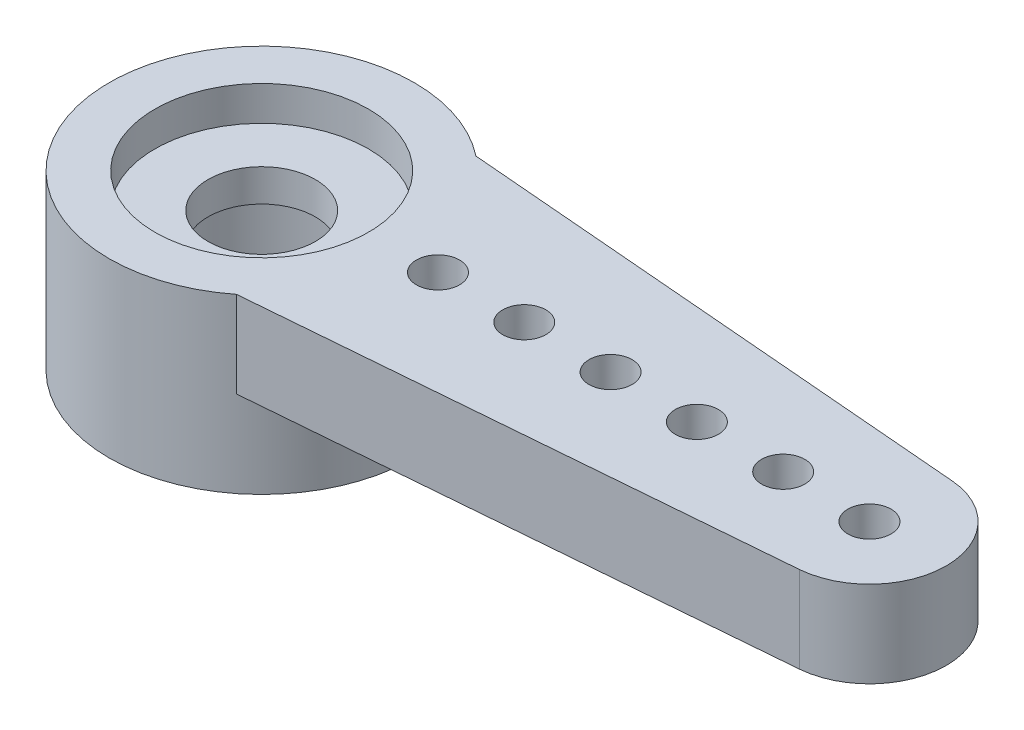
from build123d import *
from build123d.topology import SkipClean

# Parameters (mm, degrees)
BOSS_EXTRUDE1_START = 2
BOSS_EXTRUDE1_DEPTH = 2


with BuildPart() as part:
    # Sketch2 → Revolve1 (revolve)
    with BuildSketch(Plane.XY, mode=Mode.PRIVATE) as revolve1_sk:
        Polygon((2.475, 2), (2.475, 1.2), (1.245, 1.2), (1.245, 0.45), (2.375, 0.45), (2.375, -2), (3.535, -2), (3.535, 2), align=None)
    revolve(revolve1_sk.sketch.rotate(Axis((0, 55, 0), (0, -1, 0)), 90), axis=Axis((0, 55, 0), (0, -1, 0)))

    # Sketch3 → Boss-Extrude1 (add)
    with BuildSketch(Plane(origin=(0, 0, 0), x_dir=(1, 0, 0), z_dir=(0, 1, 0)).offset(BOSS_EXTRUDE1_START)):
        with BuildLine():
            ThreePointArc((3.535, 0), (3.180996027, -1.541910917), (2.189885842, -2.775))
            Line((2.189885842, -2.775), (14.232465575, -1.773881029))
            ThreePointArc((14.232465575, -1.773881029), (13.044016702, -1.443867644), (12.3554, -0.420575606))
            ThreePointArc((12.3554, -0.420575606), (11.845417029, -0.438862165), (11.585, 0))
            Line((11.585, 0), (10.585, 0))
            ThreePointArc((10.585, 0), (10.085, -0.5), (9.585, 0))
            Line((9.585, 0), (8.585, 0))
            ThreePointArc((8.585, 0), (8.085, -0.5), (7.585, 0))
            Line((7.585, 0), (6.585, 0))
            ThreePointArc((6.585, 0), (6.085, -0.5), (5.585, 0))
            Line((5.585, 0), (4.585, 0))
            ThreePointArc((4.585, 0), (4.085, -0.5), (3.585, 0))
            Line((3.585, 0), (3.535, 0))
        make_face()
        with BuildLine():
            ThreePointArc((12.3554, -0.420575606), (13.044016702, -1.443867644), (14.232465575, -1.773881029))
            ThreePointArc((14.232465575, -1.773881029), (15.394749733, -1.205386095), (15.865, 0))
            Line((15.865, 0), (14.585, 0))
            ThreePointArc((14.585, 0), (14.085, -0.5), (13.585, 0))
            Line((13.585, 0), (12.585, 0))
            ThreePointArc((12.585, 0), (12.523862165, -0.239582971), (12.3554, -0.420575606))
        make_face()
    boss_extrude1 = extrude(amount=-BOSS_EXTRUDE1_DEPTH)

    # Mirror1: Boss-Extrude1 across plane
    with SkipClean():  # the faces are left unmerged after this step: merging them gives an invalid solid
        add(boss_extrude1.mirror(Plane(origin=(0, 15.95383002, 0), x_dir=(1, 0, 0), z_dir=(0, 0, -1))))


solid = part.part
